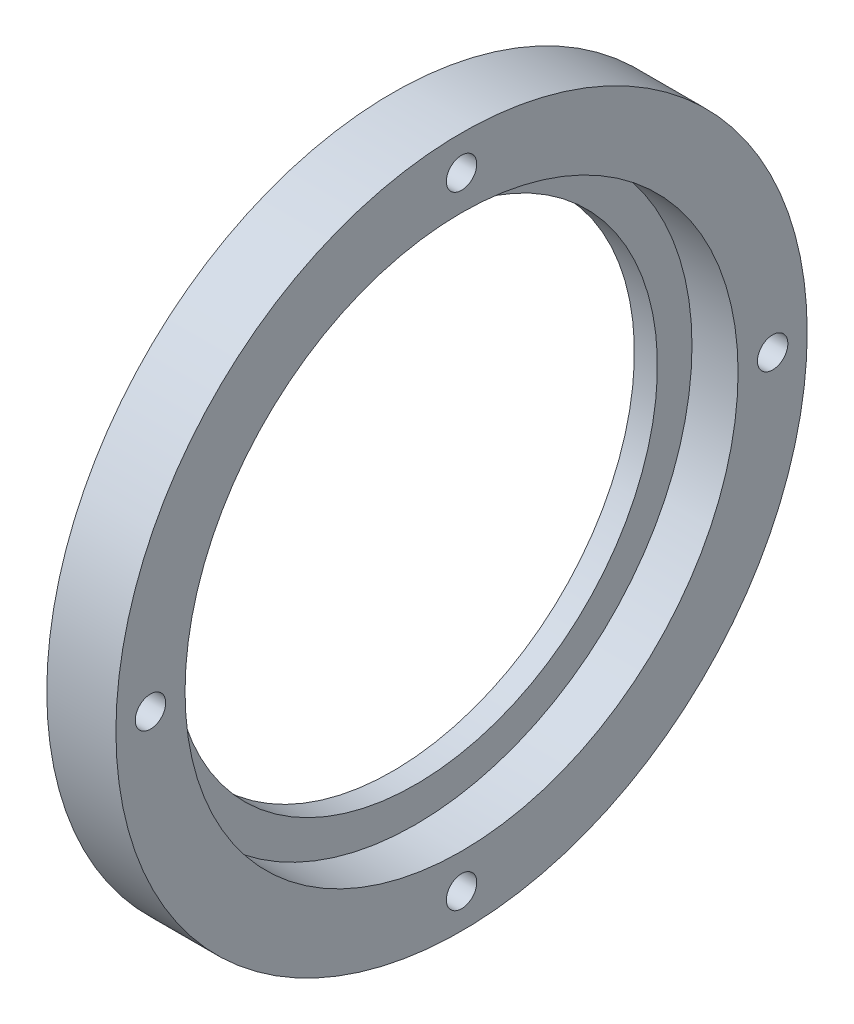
from build123d import *

# Parameters (mm, degrees)
PER_AGE1_D = 6.6


with BuildPart() as part:
    # Esquisse1 → Base-R_volution (revolve)
    with BuildSketch(Plane.XY, mode=Mode.PRIVATE) as base_r_volution_sk:
        Polygon((0, 52.5), (0, 75), (15, 75), (15, 60), (5, 60), (5, 52.5), align=None)
    revolve(base_r_volution_sk.sketch.rotate(Axis((-16.708877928, 0, 0), (1, 0, 0)), 90), axis=Axis((-16.708877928, 0, 0), (1, 0, 0)))

    # Per_age1 (through all)
    with Locations(Plane.ZY):
        with Locations((0, 67.5), (67.5, 0), (0, -67.5), (-67.5, 0)):
            Hole(PER_AGE1_D / 2)


solid = part.part
